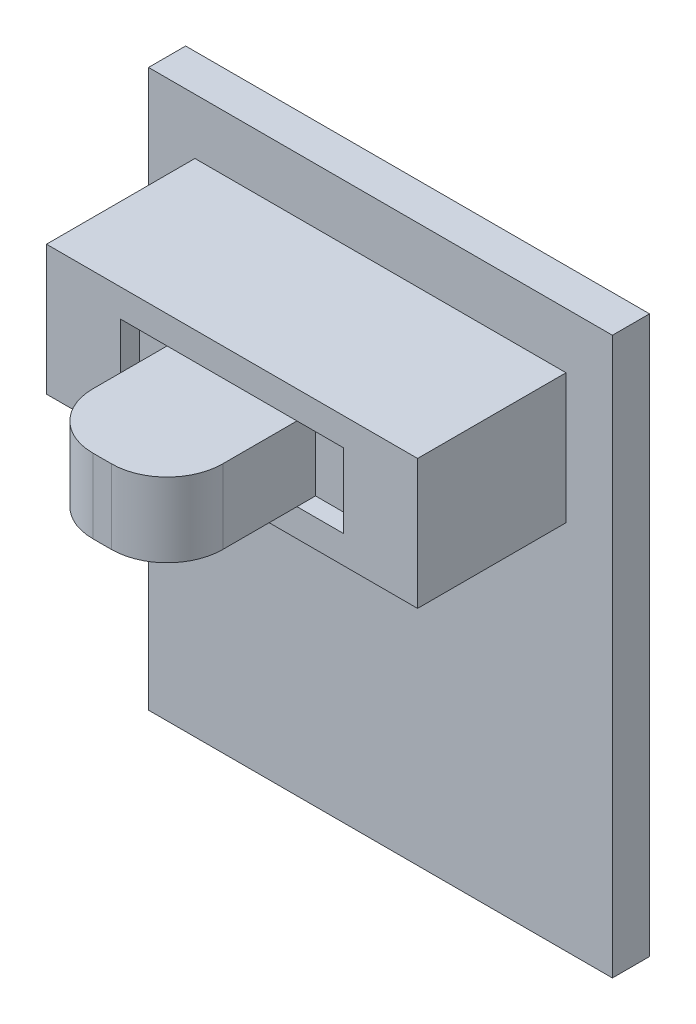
ISO-10303-21;
HEADER;
FILE_DESCRIPTION(('STEP AP214'),'2;1');
FILE_NAME('part.step','',(''),(''),'','','');
FILE_SCHEMA(('AUTOMOTIVE_DESIGN { 1 0 10303 214 1 1 1 1 }'));
ENDSEC;
DATA;
#1=APPLICATION_CONTEXT('core data for automotive mechanical design processes');
#2=APPLICATION_PROTOCOL_DEFINITION('international standard','automotive_design',2000,#1);
#3=PRODUCT_CONTEXT('',#1,'mechanical');
#4=PRODUCT('Part','Part','',(#3));
#5=PRODUCT_RELATED_PRODUCT_CATEGORY('part','',(#4));
#6=PRODUCT_DEFINITION_FORMATION('','',#4);
#7=PRODUCT_DEFINITION_CONTEXT('part definition',#1,'design');
#8=PRODUCT_DEFINITION('design','',#6,#7);
#9=PRODUCT_DEFINITION_SHAPE('','',#8);
#10=(LENGTH_UNIT() NAMED_UNIT(*) SI_UNIT(.MILLI.,.METRE.));
#11=(NAMED_UNIT(*) PLANE_ANGLE_UNIT() SI_UNIT($,.RADIAN.));
#12=(NAMED_UNIT(*) SI_UNIT($,.STERADIAN.) SOLID_ANGLE_UNIT());
#13=UNCERTAINTY_MEASURE_WITH_UNIT(LENGTH_MEASURE(1.E-05),#10,'distance_accuracy_value','');
#14=(GEOMETRIC_REPRESENTATION_CONTEXT(3) GLOBAL_UNCERTAINTY_ASSIGNED_CONTEXT((#13)) GLOBAL_UNIT_ASSIGNED_CONTEXT((#10,
#11,#12)) REPRESENTATION_CONTEXT('',''));
#15=CARTESIAN_POINT('',(0.,0.,0.));
#16=DIRECTION('',(0.,0.,1.));
#17=DIRECTION('',(1.,0.,0.));
#18=AXIS2_PLACEMENT_3D('',#15,#16,#17);
#19=CARTESIAN_POINT('',(6.5,25.5,8.));
#20=DIRECTION('',(0.,1.,0.));
#21=DIRECTION('',(0.,0.,1.));
#22=AXIS2_PLACEMENT_3D('',#19,#20,#21);
#23=PLANE('',#22);
#24=DIRECTION('',(0.,0.,-1.));
#25=VECTOR('',#24,1.);
#26=CARTESIAN_POINT('',(16.,25.5,17.));
#27=LINE('',#26,#25);
#28=CARTESIAN_POINT('',(16.,25.5,10.));
#29=VERTEX_POINT('',#28);
#30=CARTESIAN_POINT('',(16.,25.5,9.));
#31=VERTEX_POINT('',#30);
#32=EDGE_CURVE('E170',#29,#31,#27,.T.);
#33=ORIENTED_EDGE('',*,*,#32,.T.);
#34=DIRECTION('',(-1.,0.,0.));
#35=VECTOR('',#34,1.);
#36=CARTESIAN_POINT('',(6.5,25.5,9.));
#37=LINE('',#36,#35);
#38=CARTESIAN_POINT('',(18.5,25.5,9.));
#39=VERTEX_POINT('',#38);
#40=EDGE_CURVE('E182',#39,#31,#37,.T.);
#41=ORIENTED_EDGE('',*,*,#40,.F.);
#42=DIRECTION('',(0.,0.,1.));
#43=VECTOR('',#42,1.);
#44=CARTESIAN_POINT('',(18.5,25.5,8.));
#45=LINE('',#44,#43);
#46=CARTESIAN_POINT('',(18.5,25.5,10.));
#47=VERTEX_POINT('',#46);
#48=EDGE_CURVE('E214',#39,#47,#45,.T.);
#49=ORIENTED_EDGE('',*,*,#48,.T.);
#50=DIRECTION('',(-1.,0.,0.));
#51=VECTOR('',#50,1.);
#52=CARTESIAN_POINT('',(6.5,25.5,10.));
#53=LINE('',#52,#51);
#54=EDGE_CURVE('E185',#47,#29,#53,.T.);
#55=ORIENTED_EDGE('',*,*,#54,.T.);
#56=EDGE_LOOP('',(#33,#41,#49,#55));
#57=FACE_BOUND('',#56,.T.);
#58=ADVANCED_FACE('F30',(#57),#23,.F.);
#59=DIRECTION('',(0.,0.,-1.));
#60=VECTOR('',#59,1.);
#61=CARTESIAN_POINT('',(9.,25.5,17.));
#62=LINE('',#61,#60);
#63=CARTESIAN_POINT('',(9.,25.5,10.));
#64=VERTEX_POINT('',#63);
#65=CARTESIAN_POINT('',(9.,25.5,9.));
#66=VERTEX_POINT('',#65);
#67=EDGE_CURVE('E317',#64,#66,#62,.T.);
#68=ORIENTED_EDGE('',*,*,#67,.F.);
#69=CARTESIAN_POINT('',(6.5,25.5,10.));
#70=VERTEX_POINT('',#69);
#71=EDGE_CURVE('E207',#64,#70,#53,.T.);
#72=ORIENTED_EDGE('',*,*,#71,.T.);
#73=DIRECTION('',(0.,0.,1.));
#74=VECTOR('',#73,1.);
#75=CARTESIAN_POINT('',(6.5,25.5,8.));
#76=LINE('',#75,#74);
#77=CARTESIAN_POINT('',(6.5,25.5,9.));
#78=VERTEX_POINT('',#77);
#79=EDGE_CURVE('E210',#78,#70,#76,.T.);
#80=ORIENTED_EDGE('',*,*,#79,.F.);
#81=EDGE_CURVE('E193',#66,#78,#37,.T.);
#82=ORIENTED_EDGE('',*,*,#81,.F.);
#83=EDGE_LOOP('',(#68,#72,#80,#82));
#84=FACE_BOUND('',#83,.T.);
#85=ADVANCED_FACE('F351',(#84),#23,.F.);
#86=CARTESIAN_POINT('',(6.5,21.5,8.));
#87=DIRECTION('',(0.,-1.,0.));
#88=DIRECTION('',(0.,0.,-1.));
#89=AXIS2_PLACEMENT_3D('',#86,#87,#88);
#90=PLANE('',#89);
#91=DIRECTION('',(0.,0.,-1.));
#92=VECTOR('',#91,1.);
#93=CARTESIAN_POINT('',(16.,21.5,17.));
#94=LINE('',#93,#92);
#95=CARTESIAN_POINT('',(16.,21.5,10.));
#96=VERTEX_POINT('',#95);
#97=CARTESIAN_POINT('',(16.,21.5,9.));
#98=VERTEX_POINT('',#97);
#99=EDGE_CURVE('E173',#96,#98,#94,.T.);
#100=ORIENTED_EDGE('',*,*,#99,.F.);
#101=DIRECTION('',(1.,0.,0.));
#102=VECTOR('',#101,1.);
#103=CARTESIAN_POINT('',(6.5,21.5,10.));
#104=LINE('',#103,#102);
#105=CARTESIAN_POINT('',(18.5,21.5,10.));
#106=VERTEX_POINT('',#105);
#107=EDGE_CURVE('E196',#96,#106,#104,.T.);
#108=ORIENTED_EDGE('',*,*,#107,.T.);
#109=DIRECTION('',(0.,0.,1.));
#110=VECTOR('',#109,1.);
#111=CARTESIAN_POINT('',(18.5,21.5,8.));
#112=LINE('',#111,#110);
#113=CARTESIAN_POINT('',(18.5,21.5,9.));
#114=VERTEX_POINT('',#113);
#115=EDGE_CURVE('E216',#114,#106,#112,.T.);
#116=ORIENTED_EDGE('',*,*,#115,.F.);
#117=DIRECTION('',(1.,0.,0.));
#118=VECTOR('',#117,1.);
#119=CARTESIAN_POINT('',(6.5,21.5,9.));
#120=LINE('',#119,#118);
#121=EDGE_CURVE('E329',#98,#114,#120,.T.);
#122=ORIENTED_EDGE('',*,*,#121,.F.);
#123=EDGE_LOOP('',(#100,#108,#116,#122));
#124=FACE_BOUND('',#123,.T.);
#125=ADVANCED_FACE('F340',(#124),#90,.F.);
#126=DIRECTION('',(0.,0.,-1.));
#127=VECTOR('',#126,1.);
#128=CARTESIAN_POINT('',(9.,21.5,17.));
#129=LINE('',#128,#127);
#130=CARTESIAN_POINT('',(9.,21.5,10.));
#131=VERTEX_POINT('',#130);
#132=CARTESIAN_POINT('',(9.,21.5,9.));
#133=VERTEX_POINT('',#132);
#134=EDGE_CURVE('E315',#131,#133,#129,.T.);
#135=ORIENTED_EDGE('',*,*,#134,.T.);
#136=CARTESIAN_POINT('',(6.5,21.5,9.));
#137=VERTEX_POINT('',#136);
#138=EDGE_CURVE('E330',#137,#133,#120,.T.);
#139=ORIENTED_EDGE('',*,*,#138,.F.);
#140=DIRECTION('',(0.,0.,1.));
#141=VECTOR('',#140,1.);
#142=CARTESIAN_POINT('',(6.5,21.5,8.));
#143=LINE('',#142,#141);
#144=CARTESIAN_POINT('',(6.5,21.5,10.));
#145=VERTEX_POINT('',#144);
#146=EDGE_CURVE('E209',#137,#145,#143,.T.);
#147=ORIENTED_EDGE('',*,*,#146,.T.);
#148=EDGE_CURVE('E201',#145,#131,#104,.T.);
#149=ORIENTED_EDGE('',*,*,#148,.T.);
#150=EDGE_LOOP('',(#135,#139,#147,#149));
#151=FACE_BOUND('',#150,.T.);
#152=ADVANCED_FACE('F380',(#151),#90,.F.);
#153=CARTESIAN_POINT('',(6.5,21.5,9.));
#154=DIRECTION('',(0.,0.,1.));
#155=DIRECTION('',(1.,0.,0.));
#156=AXIS2_PLACEMENT_3D('',#153,#154,#155);
#157=PLANE('',#156);
#158=ORIENTED_EDGE('',*,*,#40,.T.);
#159=DIRECTION('',(0.,1.,0.));
#160=VECTOR('',#159,1.);
#161=CARTESIAN_POINT('',(16.,25.5,9.));
#162=LINE('',#161,#160);
#163=EDGE_CURVE('E167',#98,#31,#162,.T.);
#164=ORIENTED_EDGE('',*,*,#163,.F.);
#165=ORIENTED_EDGE('',*,*,#121,.T.);
#166=DIRECTION('',(0.,1.,0.));
#167=VECTOR('',#166,1.);
#168=CARTESIAN_POINT('',(18.5,25.5,9.));
#169=LINE('',#168,#167);
#170=EDGE_CURVE('E191',#114,#39,#169,.T.);
#171=ORIENTED_EDGE('',*,*,#170,.T.);
#172=EDGE_LOOP('',(#158,#164,#165,#171));
#173=FACE_BOUND('',#172,.T.);
#174=ADVANCED_FACE('F189',(#173),#157,.T.);
#175=ORIENTED_EDGE('',*,*,#138,.T.);
#176=DIRECTION('',(0.,-1.,0.));
#177=VECTOR('',#176,1.);
#178=CARTESIAN_POINT('',(9.,25.5,9.));
#179=LINE('',#178,#177);
#180=EDGE_CURVE('E177',#66,#133,#179,.T.);
#181=ORIENTED_EDGE('',*,*,#180,.F.);
#182=ORIENTED_EDGE('',*,*,#81,.T.);
#183=DIRECTION('',(0.,-1.,0.));
#184=VECTOR('',#183,1.);
#185=CARTESIAN_POINT('',(6.5,25.5,9.));
#186=LINE('',#185,#184);
#187=EDGE_CURVE('E328',#78,#137,#186,.T.);
#188=ORIENTED_EDGE('',*,*,#187,.T.);
#189=EDGE_LOOP('',(#175,#181,#182,#188));
#190=FACE_BOUND('',#189,.T.);
#191=ADVANCED_FACE('F353',(#190),#157,.T.);
#192=CARTESIAN_POINT('',(0.,30.,2.));
#193=DIRECTION('',(0.,0.,-1.));
#194=DIRECTION('',(-1.,0.,0.));
#195=AXIS2_PLACEMENT_3D('',#192,#193,#194);
#196=PLANE('',#195);
#197=DIRECTION('',(0.,-1.,0.));
#198=VECTOR('',#197,1.);
#199=CARTESIAN_POINT('',(0.,0.,2.));
#200=LINE('',#199,#198);
#201=CARTESIAN_POINT('',(0.,30.,2.));
#202=VERTEX_POINT('',#201);
#203=CARTESIAN_POINT('',(0.,0.,2.));
#204=VERTEX_POINT('',#203);
#205=EDGE_CURVE('E261',#202,#204,#200,.T.);
#206=ORIENTED_EDGE('',*,*,#205,.T.);
#207=DIRECTION('',(1.,0.,0.));
#208=VECTOR('',#207,1.);
#209=CARTESIAN_POINT('',(0.,0.,2.));
#210=LINE('',#209,#208);
#211=CARTESIAN_POINT('',(25.,0.,2.));
#212=VERTEX_POINT('',#211);
#213=EDGE_CURVE('E264',#204,#212,#210,.T.);
#214=ORIENTED_EDGE('',*,*,#213,.T.);
#215=DIRECTION('',(0.,1.,0.));
#216=VECTOR('',#215,1.);
#217=CARTESIAN_POINT('',(25.,0.,2.));
#218=LINE('',#217,#216);
#219=CARTESIAN_POINT('',(25.,30.,2.));
#220=VERTEX_POINT('',#219);
#221=EDGE_CURVE('E266',#212,#220,#218,.T.);
#222=ORIENTED_EDGE('',*,*,#221,.T.);
#223=DIRECTION('',(-1.,0.,0.));
#224=VECTOR('',#223,1.);
#225=CARTESIAN_POINT('',(0.,30.,2.));
#226=LINE('',#225,#224);
#227=EDGE_CURVE('E268',#220,#202,#226,.T.);
#228=ORIENTED_EDGE('',*,*,#227,.T.);
#229=EDGE_LOOP('',(#206,#214,#222,#228));
#230=FACE_BOUND('',#229,.T.);
#231=DIRECTION('',(0.,-1.,0.));
#232=VECTOR('',#231,1.);
#233=CARTESIAN_POINT('',(2.5,27.,2.));
#234=LINE('',#233,#232);
#235=CARTESIAN_POINT('',(2.5,27.,2.));
#236=VERTEX_POINT('',#235);
#237=CARTESIAN_POINT('',(2.5,20.,2.));
#238=VERTEX_POINT('',#237);
#239=EDGE_CURVE('E213',#236,#238,#234,.T.);
#240=ORIENTED_EDGE('',*,*,#239,.F.);
#241=DIRECTION('',(-1.,0.,0.));
#242=VECTOR('',#241,1.);
#243=CARTESIAN_POINT('',(2.5,27.,2.));
#244=LINE('',#243,#242);
#245=CARTESIAN_POINT('',(22.5,27.,2.));
#246=VERTEX_POINT('',#245);
#247=EDGE_CURVE('E228',#246,#236,#244,.T.);
#248=ORIENTED_EDGE('',*,*,#247,.F.);
#249=DIRECTION('',(0.,1.,0.));
#250=VECTOR('',#249,1.);
#251=CARTESIAN_POINT('',(22.5,27.,2.));
#252=LINE('',#251,#250);
#253=CARTESIAN_POINT('',(22.5,20.,2.));
#254=VERTEX_POINT('',#253);
#255=EDGE_CURVE('E225',#254,#246,#252,.T.);
#256=ORIENTED_EDGE('',*,*,#255,.F.);
#257=DIRECTION('',(1.,0.,0.));
#258=VECTOR('',#257,1.);
#259=CARTESIAN_POINT('',(2.5,20.,2.));
#260=LINE('',#259,#258);
#261=EDGE_CURVE('E222',#238,#254,#260,.T.);
#262=ORIENTED_EDGE('',*,*,#261,.F.);
#263=EDGE_LOOP('',(#240,#248,#256,#262));
#264=FACE_BOUND('',#263,.T.);
#265=ADVANCED_FACE('F407',(#230,#264),#196,.F.);
#266=CARTESIAN_POINT('',(0.,0.,2.));
#267=DIRECTION('',(1.,0.,0.));
#268=DIRECTION('',(0.,0.,-1.));
#269=AXIS2_PLACEMENT_3D('',#266,#267,#268);
#270=PLANE('',#269);
#271=DIRECTION('',(0.,-1.,0.));
#272=VECTOR('',#271,1.);
#273=CARTESIAN_POINT('',(0.,0.,0.));
#274=LINE('',#273,#272);
#275=CARTESIAN_POINT('',(0.,30.,0.));
#276=VERTEX_POINT('',#275);
#277=CARTESIAN_POINT('',(0.,0.,0.));
#278=VERTEX_POINT('',#277);
#279=EDGE_CURVE('E252',#276,#278,#274,.T.);
#280=ORIENTED_EDGE('',*,*,#279,.T.);
#281=DIRECTION('',(0.,0.,-1.));
#282=VECTOR('',#281,1.);
#283=CARTESIAN_POINT('',(0.,0.,2.));
#284=LINE('',#283,#282);
#285=EDGE_CURVE('E279',#204,#278,#284,.T.);
#286=ORIENTED_EDGE('',*,*,#285,.F.);
#287=ORIENTED_EDGE('',*,*,#205,.F.);
#288=DIRECTION('',(0.,0.,-1.));
#289=VECTOR('',#288,1.);
#290=CARTESIAN_POINT('',(0.,30.,2.));
#291=LINE('',#290,#289);
#292=EDGE_CURVE('E270',#202,#276,#291,.T.);
#293=ORIENTED_EDGE('',*,*,#292,.T.);
#294=EDGE_LOOP('',(#280,#286,#287,#293));
#295=FACE_BOUND('',#294,.T.);
#296=ADVANCED_FACE('F32',(#295),#270,.F.);
#297=CARTESIAN_POINT('',(0.,0.,2.));
#298=DIRECTION('',(0.,1.,0.));
#299=DIRECTION('',(0.,0.,1.));
#300=AXIS2_PLACEMENT_3D('',#297,#298,#299);
#301=PLANE('',#300);
#302=DIRECTION('',(1.,0.,0.));
#303=VECTOR('',#302,1.);
#304=CARTESIAN_POINT('',(0.,0.,0.));
#305=LINE('',#304,#303);
#306=CARTESIAN_POINT('',(25.,0.,0.));
#307=VERTEX_POINT('',#306);
#308=EDGE_CURVE('E255',#278,#307,#305,.T.);
#309=ORIENTED_EDGE('',*,*,#308,.T.);
#310=DIRECTION('',(0.,0.,-1.));
#311=VECTOR('',#310,1.);
#312=CARTESIAN_POINT('',(25.,0.,2.));
#313=LINE('',#312,#311);
#314=EDGE_CURVE('E276',#212,#307,#313,.T.);
#315=ORIENTED_EDGE('',*,*,#314,.F.);
#316=ORIENTED_EDGE('',*,*,#213,.F.);
#317=ORIENTED_EDGE('',*,*,#285,.T.);
#318=EDGE_LOOP('',(#309,#315,#316,#317));
#319=FACE_BOUND('',#318,.T.);
#320=ADVANCED_FACE('F416',(#319),#301,.F.);
#321=CARTESIAN_POINT('',(25.,0.,2.));
#322=DIRECTION('',(-1.,0.,0.));
#323=DIRECTION('',(0.,0.,1.));
#324=AXIS2_PLACEMENT_3D('',#321,#322,#323);
#325=PLANE('',#324);
#326=DIRECTION('',(0.,1.,0.));
#327=VECTOR('',#326,1.);
#328=CARTESIAN_POINT('',(25.,0.,0.));
#329=LINE('',#328,#327);
#330=CARTESIAN_POINT('',(25.,30.,0.));
#331=VERTEX_POINT('',#330);
#332=EDGE_CURVE('E257',#307,#331,#329,.T.);
#333=ORIENTED_EDGE('',*,*,#332,.T.);
#334=DIRECTION('',(0.,0.,-1.));
#335=VECTOR('',#334,1.);
#336=CARTESIAN_POINT('',(25.,30.,2.));
#337=LINE('',#336,#335);
#338=EDGE_CURVE('E273',#220,#331,#337,.T.);
#339=ORIENTED_EDGE('',*,*,#338,.F.);
#340=ORIENTED_EDGE('',*,*,#221,.F.);
#341=ORIENTED_EDGE('',*,*,#314,.T.);
#342=EDGE_LOOP('',(#333,#339,#340,#341));
#343=FACE_BOUND('',#342,.T.);
#344=ADVANCED_FACE('F413',(#343),#325,.F.);
#345=CARTESIAN_POINT('',(0.,30.,2.));
#346=DIRECTION('',(0.,-1.,0.));
#347=DIRECTION('',(0.,0.,-1.));
#348=AXIS2_PLACEMENT_3D('',#345,#346,#347);
#349=PLANE('',#348);
#350=DIRECTION('',(-1.,0.,0.));
#351=VECTOR('',#350,1.);
#352=CARTESIAN_POINT('',(0.,30.,0.));
#353=LINE('',#352,#351);
#354=EDGE_CURVE('E259',#331,#276,#353,.T.);
#355=ORIENTED_EDGE('',*,*,#354,.T.);
#356=ORIENTED_EDGE('',*,*,#292,.F.);
#357=ORIENTED_EDGE('',*,*,#227,.F.);
#358=ORIENTED_EDGE('',*,*,#338,.T.);
#359=EDGE_LOOP('',(#355,#356,#357,#358));
#360=FACE_BOUND('',#359,.T.);
#361=ADVANCED_FACE('F405',(#360),#349,.F.);
#362=CARTESIAN_POINT('',(0.,30.,0.));
#363=DIRECTION('',(0.,0.,-1.));
#364=DIRECTION('',(-1.,0.,0.));
#365=AXIS2_PLACEMENT_3D('',#362,#363,#364);
#366=PLANE('',#365);
#367=ORIENTED_EDGE('',*,*,#279,.F.);
#368=ORIENTED_EDGE('',*,*,#354,.F.);
#369=ORIENTED_EDGE('',*,*,#332,.F.);
#370=ORIENTED_EDGE('',*,*,#308,.F.);
#371=EDGE_LOOP('',(#367,#368,#369,#370));
#372=FACE_BOUND('',#371,.T.);
#373=ADVANCED_FACE('F401',(#372),#366,.T.);
#374=CARTESIAN_POINT('',(2.5,27.,10.));
#375=DIRECTION('',(1.,0.,0.));
#376=DIRECTION('',(0.,1.,0.));
#377=AXIS2_PLACEMENT_3D('',#374,#375,#376);
#378=PLANE('',#377);
#379=ORIENTED_EDGE('',*,*,#239,.T.);
#380=DIRECTION('',(0.,0.,-1.));
#381=VECTOR('',#380,1.);
#382=CARTESIAN_POINT('',(2.5,20.,10.));
#383=LINE('',#382,#381);
#384=CARTESIAN_POINT('',(2.5,20.,10.));
#385=VERTEX_POINT('',#384);
#386=EDGE_CURVE('E249',#385,#238,#383,.T.);
#387=ORIENTED_EDGE('',*,*,#386,.F.);
#388=DIRECTION('',(0.,-1.,0.));
#389=VECTOR('',#388,1.);
#390=CARTESIAN_POINT('',(2.5,27.,10.));
#391=LINE('',#390,#389);
#392=CARTESIAN_POINT('',(2.5,27.,10.));
#393=VERTEX_POINT('',#392);
#394=EDGE_CURVE('E231',#393,#385,#391,.T.);
#395=ORIENTED_EDGE('',*,*,#394,.F.);
#396=DIRECTION('',(0.,0.,-1.));
#397=VECTOR('',#396,1.);
#398=CARTESIAN_POINT('',(2.5,27.,10.));
#399=LINE('',#398,#397);
#400=EDGE_CURVE('E240',#393,#236,#399,.T.);
#401=ORIENTED_EDGE('',*,*,#400,.T.);
#402=EDGE_LOOP('',(#379,#387,#395,#401));
#403=FACE_BOUND('',#402,.T.);
#404=ADVANCED_FACE('F397',(#403),#378,.F.);
#405=CARTESIAN_POINT('',(2.5,20.,10.));
#406=DIRECTION('',(0.,1.,0.));
#407=DIRECTION('',(0.,0.,1.));
#408=AXIS2_PLACEMENT_3D('',#405,#406,#407);
#409=PLANE('',#408);
#410=ORIENTED_EDGE('',*,*,#261,.T.);
#411=DIRECTION('',(0.,0.,-1.));
#412=VECTOR('',#411,1.);
#413=CARTESIAN_POINT('',(22.5,20.,10.));
#414=LINE('',#413,#412);
#415=CARTESIAN_POINT('',(22.5,20.,10.));
#416=VERTEX_POINT('',#415);
#417=EDGE_CURVE('E246',#416,#254,#414,.T.);
#418=ORIENTED_EDGE('',*,*,#417,.F.);
#419=DIRECTION('',(1.,0.,0.));
#420=VECTOR('',#419,1.);
#421=CARTESIAN_POINT('',(2.5,20.,10.));
#422=LINE('',#421,#420);
#423=EDGE_CURVE('E234',#385,#416,#422,.T.);
#424=ORIENTED_EDGE('',*,*,#423,.F.);
#425=ORIENTED_EDGE('',*,*,#386,.T.);
#426=EDGE_LOOP('',(#410,#418,#424,#425));
#427=FACE_BOUND('',#426,.T.);
#428=ADVANCED_FACE('F393',(#427),#409,.F.);
#429=CARTESIAN_POINT('',(22.5,27.,10.));
#430=DIRECTION('',(-1.,0.,0.));
#431=DIRECTION('',(0.,0.,1.));
#432=AXIS2_PLACEMENT_3D('',#429,#430,#431);
#433=PLANE('',#432);
#434=ORIENTED_EDGE('',*,*,#255,.T.);
#435=DIRECTION('',(0.,0.,-1.));
#436=VECTOR('',#435,1.);
#437=CARTESIAN_POINT('',(22.5,27.,10.));
#438=LINE('',#437,#436);
#439=CARTESIAN_POINT('',(22.5,27.,10.));
#440=VERTEX_POINT('',#439);
#441=EDGE_CURVE('E243',#440,#246,#438,.T.);
#442=ORIENTED_EDGE('',*,*,#441,.F.);
#443=DIRECTION('',(0.,1.,0.));
#444=VECTOR('',#443,1.);
#445=CARTESIAN_POINT('',(22.5,27.,10.));
#446=LINE('',#445,#444);
#447=EDGE_CURVE('E236',#416,#440,#446,.T.);
#448=ORIENTED_EDGE('',*,*,#447,.F.);
#449=ORIENTED_EDGE('',*,*,#417,.T.);
#450=EDGE_LOOP('',(#434,#442,#448,#449));
#451=FACE_BOUND('',#450,.T.);
#452=ADVANCED_FACE('F389',(#451),#433,.F.);
#453=CARTESIAN_POINT('',(2.5,27.,10.));
#454=DIRECTION('',(0.,-1.,0.));
#455=DIRECTION('',(0.,0.,-1.));
#456=AXIS2_PLACEMENT_3D('',#453,#454,#455);
#457=PLANE('',#456);
#458=ORIENTED_EDGE('',*,*,#247,.T.);
#459=ORIENTED_EDGE('',*,*,#400,.F.);
#460=DIRECTION('',(-1.,0.,0.));
#461=VECTOR('',#460,1.);
#462=CARTESIAN_POINT('',(2.5,27.,10.));
#463=LINE('',#462,#461);
#464=EDGE_CURVE('E238',#440,#393,#463,.T.);
#465=ORIENTED_EDGE('',*,*,#464,.F.);
#466=ORIENTED_EDGE('',*,*,#441,.T.);
#467=EDGE_LOOP('',(#458,#459,#465,#466));
#468=FACE_BOUND('',#467,.T.);
#469=ADVANCED_FACE('F386',(#468),#457,.F.);
#470=CARTESIAN_POINT('',(2.5,20.,10.));
#471=DIRECTION('',(0.,0.,1.));
#472=DIRECTION('',(1.,0.,0.));
#473=AXIS2_PLACEMENT_3D('',#470,#471,#472);
#474=PLANE('',#473);
#475=DIRECTION('',(0.,-1.,0.));
#476=VECTOR('',#475,1.);
#477=CARTESIAN_POINT('',(6.5,25.5,10.));
#478=LINE('',#477,#476);
#479=EDGE_CURVE('E192',#70,#145,#478,.T.);
#480=ORIENTED_EDGE('',*,*,#479,.F.);
#481=ORIENTED_EDGE('',*,*,#71,.F.);
#482=DIRECTION('',(1.,0.,0.));
#483=VECTOR('',#482,1.);
#484=CARTESIAN_POINT('',(2.5,25.5,10.));
#485=LINE('',#484,#483);
#486=EDGE_CURVE('E326',#64,#29,#485,.T.);
#487=ORIENTED_EDGE('',*,*,#486,.T.);
#488=ORIENTED_EDGE('',*,*,#54,.F.);
#489=DIRECTION('',(0.,1.,0.));
#490=VECTOR('',#489,1.);
#491=CARTESIAN_POINT('',(18.5,25.5,10.));
#492=LINE('',#491,#490);
#493=EDGE_CURVE('E204',#106,#47,#492,.T.);
#494=ORIENTED_EDGE('',*,*,#493,.F.);
#495=ORIENTED_EDGE('',*,*,#107,.F.);
#496=DIRECTION('',(-1.,0.,0.));
#497=VECTOR('',#496,1.);
#498=CARTESIAN_POINT('',(2.5,21.5,10.));
#499=LINE('',#498,#497);
#500=EDGE_CURVE('E324',#96,#131,#499,.T.);
#501=ORIENTED_EDGE('',*,*,#500,.T.);
#502=ORIENTED_EDGE('',*,*,#148,.F.);
#503=EDGE_LOOP('',(#480,#481,#487,#488,#494,#495,#501,#502));
#504=FACE_BOUND('',#503,.T.);
#505=ORIENTED_EDGE('',*,*,#394,.T.);
#506=ORIENTED_EDGE('',*,*,#423,.T.);
#507=ORIENTED_EDGE('',*,*,#447,.T.);
#508=ORIENTED_EDGE('',*,*,#464,.T.);
#509=EDGE_LOOP('',(#505,#506,#507,#508));
#510=FACE_BOUND('',#509,.T.);
#511=ADVANCED_FACE('F344',(#504,#510),#474,.T.);
#512=CARTESIAN_POINT('',(6.5,25.5,8.));
#513=DIRECTION('',(-1.,0.,0.));
#514=DIRECTION('',(0.,-1.,0.));
#515=AXIS2_PLACEMENT_3D('',#512,#513,#514);
#516=PLANE('',#515);
#517=ORIENTED_EDGE('',*,*,#146,.F.);
#518=ORIENTED_EDGE('',*,*,#187,.F.);
#519=ORIENTED_EDGE('',*,*,#79,.T.);
#520=ORIENTED_EDGE('',*,*,#479,.T.);
#521=EDGE_LOOP('',(#517,#518,#519,#520));
#522=FACE_BOUND('',#521,.T.);
#523=ADVANCED_FACE('F377',(#522),#516,.F.);
#524=CARTESIAN_POINT('',(18.5,25.5,8.));
#525=DIRECTION('',(1.,0.,0.));
#526=DIRECTION('',(0.,1.,0.));
#527=AXIS2_PLACEMENT_3D('',#524,#525,#526);
#528=PLANE('',#527);
#529=ORIENTED_EDGE('',*,*,#48,.F.);
#530=ORIENTED_EDGE('',*,*,#170,.F.);
#531=ORIENTED_EDGE('',*,*,#115,.T.);
#532=ORIENTED_EDGE('',*,*,#493,.T.);
#533=EDGE_LOOP('',(#529,#530,#531,#532));
#534=FACE_BOUND('',#533,.T.);
#535=ADVANCED_FACE('F338',(#534),#528,.F.);
#536=CARTESIAN_POINT('',(16.,25.5,17.));
#537=DIRECTION('',(-1.,0.,0.));
#538=DIRECTION('',(0.,-1.,0.));
#539=AXIS2_PLACEMENT_3D('',#536,#537,#538);
#540=PLANE('',#539);
#541=CARTESIAN_POINT('',(16.,25.5,14.));
#542=VERTEX_POINT('',#541);
#543=EDGE_CURVE('E186',#542,#29,#27,.T.);
#544=ORIENTED_EDGE('',*,*,#543,.F.);
#545=DIRECTION('',(0.,1.,0.));
#546=VECTOR('',#545,1.);
#547=CARTESIAN_POINT('',(16.,25.5,14.));
#548=LINE('',#547,#546);
#549=CARTESIAN_POINT('',(16.,21.5,14.));
#550=VERTEX_POINT('',#549);
#551=EDGE_CURVE('E11',#542,#550,#548,.F.);
#552=ORIENTED_EDGE('',*,*,#551,.T.);
#553=EDGE_CURVE('E320',#550,#96,#94,.T.);
#554=ORIENTED_EDGE('',*,*,#553,.T.);
#555=ORIENTED_EDGE('',*,*,#99,.T.);
#556=ORIENTED_EDGE('',*,*,#163,.T.);
#557=ORIENTED_EDGE('',*,*,#32,.F.);
#558=EDGE_LOOP('',(#544,#552,#554,#555,#556,#557));
#559=FACE_BOUND('',#558,.T.);
#560=ADVANCED_FACE('F169',(#559),#540,.F.);
#561=CARTESIAN_POINT('',(16.,25.5,17.));
#562=DIRECTION('',(0.,-1.,0.));
#563=DIRECTION('',(0.,0.,-1.));
#564=AXIS2_PLACEMENT_3D('',#561,#562,#563);
#565=PLANE('',#564);
#566=CARTESIAN_POINT('',(9.,25.5,14.));
#567=VERTEX_POINT('',#566);
#568=EDGE_CURVE('E187',#567,#64,#62,.T.);
#569=ORIENTED_EDGE('',*,*,#568,.F.);
#570=CARTESIAN_POINT('',(12.,25.5,14.));
#571=DIRECTION('',(0.,-1.,0.));
#572=DIRECTION('',(0.,0.,-1.));
#573=AXIS2_PLACEMENT_3D('',#570,#571,#572);
#574=CIRCLE('',#573,3.);
#575=CARTESIAN_POINT('',(12.,25.5,17.));
#576=VERTEX_POINT('',#575);
#577=EDGE_CURVE('E38',#567,#576,#574,.F.);
#578=ORIENTED_EDGE('',*,*,#577,.T.);
#579=DIRECTION('',(-1.,0.,0.));
#580=VECTOR('',#579,1.);
#581=CARTESIAN_POINT('',(16.,25.5,17.));
#582=LINE('',#581,#580);
#583=CARTESIAN_POINT('',(13.,25.5,17.));
#584=VERTEX_POINT('',#583);
#585=EDGE_CURVE('E296',#584,#576,#582,.T.);
#586=ORIENTED_EDGE('',*,*,#585,.F.);
#587=CARTESIAN_POINT('',(13.,25.5,14.));
#588=DIRECTION('',(0.,-1.,0.));
#589=DIRECTION('',(0.,0.,-1.));
#590=AXIS2_PLACEMENT_3D('',#587,#588,#589);
#591=CIRCLE('',#590,3.);
#592=EDGE_CURVE('E45',#584,#542,#591,.F.);
#593=ORIENTED_EDGE('',*,*,#592,.T.);
#594=ORIENTED_EDGE('',*,*,#543,.T.);
#595=ORIENTED_EDGE('',*,*,#486,.F.);
#596=EDGE_LOOP('',(#569,#578,#586,#593,#594,#595));
#597=FACE_BOUND('',#596,.T.);
#598=ADVANCED_FACE('F295',(#597),#565,.F.);
#599=CARTESIAN_POINT('',(9.,25.5,17.));
#600=DIRECTION('',(1.,0.,0.));
#601=DIRECTION('',(0.,0.,-1.));
#602=AXIS2_PLACEMENT_3D('',#599,#600,#601);
#603=PLANE('',#602);
#604=CARTESIAN_POINT('',(9.,21.5,14.));
#605=VERTEX_POINT('',#604);
#606=EDGE_CURVE('E311',#605,#131,#129,.T.);
#607=ORIENTED_EDGE('',*,*,#606,.F.);
#608=DIRECTION('',(0.,-1.,0.));
#609=VECTOR('',#608,1.);
#610=CARTESIAN_POINT('',(9.,25.5,14.));
#611=LINE('',#610,#609);
#612=EDGE_CURVE('E53',#605,#567,#611,.F.);
#613=ORIENTED_EDGE('',*,*,#612,.T.);
#614=ORIENTED_EDGE('',*,*,#568,.T.);
#615=ORIENTED_EDGE('',*,*,#67,.T.);
#616=ORIENTED_EDGE('',*,*,#180,.T.);
#617=ORIENTED_EDGE('',*,*,#134,.F.);
#618=EDGE_LOOP('',(#607,#613,#614,#615,#616,#617));
#619=FACE_BOUND('',#618,.T.);
#620=ADVANCED_FACE('F313',(#619),#603,.F.);
#621=CARTESIAN_POINT('',(9.,21.5,17.));
#622=DIRECTION('',(0.,1.,0.));
#623=DIRECTION('',(0.,0.,1.));
#624=AXIS2_PLACEMENT_3D('',#621,#622,#623);
#625=PLANE('',#624);
#626=DIRECTION('',(1.,0.,0.));
#627=VECTOR('',#626,1.);
#628=CARTESIAN_POINT('',(9.,21.5,17.));
#629=LINE('',#628,#627);
#630=CARTESIAN_POINT('',(12.,21.5,17.));
#631=VERTEX_POINT('',#630);
#632=CARTESIAN_POINT('',(13.,21.5,17.));
#633=VERTEX_POINT('',#632);
#634=EDGE_CURVE('E305',#631,#633,#629,.T.);
#635=ORIENTED_EDGE('',*,*,#634,.F.);
#636=CARTESIAN_POINT('',(12.,21.5,14.));
#637=DIRECTION('',(0.,1.,0.));
#638=DIRECTION('',(0.,0.,1.));
#639=AXIS2_PLACEMENT_3D('',#636,#637,#638);
#640=CIRCLE('',#639,3.);
#641=EDGE_CURVE('E290',#631,#605,#640,.F.);
#642=ORIENTED_EDGE('',*,*,#641,.T.);
#643=ORIENTED_EDGE('',*,*,#606,.T.);
#644=ORIENTED_EDGE('',*,*,#500,.F.);
#645=ORIENTED_EDGE('',*,*,#553,.F.);
#646=CARTESIAN_POINT('',(13.,21.5,14.));
#647=DIRECTION('',(0.,1.,0.));
#648=DIRECTION('',(0.,0.,1.));
#649=AXIS2_PLACEMENT_3D('',#646,#647,#648);
#650=CIRCLE('',#649,3.);
#651=EDGE_CURVE('E288',#550,#633,#650,.F.);
#652=ORIENTED_EDGE('',*,*,#651,.T.);
#653=EDGE_LOOP('',(#635,#642,#643,#644,#645,#652));
#654=FACE_BOUND('',#653,.T.);
#655=ADVANCED_FACE('F309',(#654),#625,.F.);
#656=CARTESIAN_POINT('',(16.,25.5,17.));
#657=DIRECTION('',(0.,0.,-1.));
#658=DIRECTION('',(-1.,0.,0.));
#659=AXIS2_PLACEMENT_3D('',#656,#657,#658);
#660=PLANE('',#659);
#661=ORIENTED_EDGE('',*,*,#585,.T.);
#662=DIRECTION('',(0.,-1.,0.));
#663=VECTOR('',#662,1.);
#664=CARTESIAN_POINT('',(12.,25.5,17.));
#665=LINE('',#664,#663);
#666=EDGE_CURVE('E285',#576,#631,#665,.T.);
#667=ORIENTED_EDGE('',*,*,#666,.T.);
#668=ORIENTED_EDGE('',*,*,#634,.T.);
#669=DIRECTION('',(0.,1.,0.));
#670=VECTOR('',#669,1.);
#671=CARTESIAN_POINT('',(13.,25.5,17.));
#672=LINE('',#671,#670);
#673=EDGE_CURVE('E282',#633,#584,#672,.T.);
#674=ORIENTED_EDGE('',*,*,#673,.T.);
#675=EDGE_LOOP('',(#661,#667,#668,#674));
#676=FACE_BOUND('',#675,.T.);
#677=ADVANCED_FACE('F301',(#676),#660,.F.);
#678=CARTESIAN_POINT('',(12.,25.5,14.));
#679=DIRECTION('',(0.,-1.,0.));
#680=DIRECTION('',(0.,0.,-1.));
#681=AXIS2_PLACEMENT_3D('',#678,#679,#680);
#682=CYLINDRICAL_SURFACE('',#681,3.);
#683=ORIENTED_EDGE('',*,*,#577,.F.);
#684=ORIENTED_EDGE('',*,*,#612,.F.);
#685=ORIENTED_EDGE('',*,*,#641,.F.);
#686=ORIENTED_EDGE('',*,*,#666,.F.);
#687=EDGE_LOOP('',(#683,#684,#685,#686));
#688=FACE_BOUND('',#687,.T.);
#689=ADVANCED_FACE('F307',(#688),#682,.T.);
#690=CARTESIAN_POINT('',(13.,25.5,14.));
#691=DIRECTION('',(0.,1.,0.));
#692=DIRECTION('',(-1.,0.,0.));
#693=AXIS2_PLACEMENT_3D('',#690,#691,#692);
#694=CYLINDRICAL_SURFACE('',#693,3.);
#695=ORIENTED_EDGE('',*,*,#651,.F.);
#696=ORIENTED_EDGE('',*,*,#551,.F.);
#697=ORIENTED_EDGE('',*,*,#592,.F.);
#698=ORIENTED_EDGE('',*,*,#673,.F.);
#699=EDGE_LOOP('',(#695,#696,#697,#698));
#700=FACE_BOUND('',#699,.T.);
#701=ADVANCED_FACE('F360',(#700),#694,.T.);
#702=CLOSED_SHELL('',(#58,#85,#125,#152,#174,#191,#265,#296,#320,#344,#361,#373,#404,#428,#452,
#469,#511,#523,#535,#560,#598,#620,#655,#677,#689,#701));
#703=MANIFOLD_SOLID_BREP('B2',#702);
#704=ADVANCED_BREP_SHAPE_REPRESENTATION('',(#18,#703),#14);
#705=SHAPE_DEFINITION_REPRESENTATION(#9,#704);
ENDSEC;
END-ISO-10303-21;
